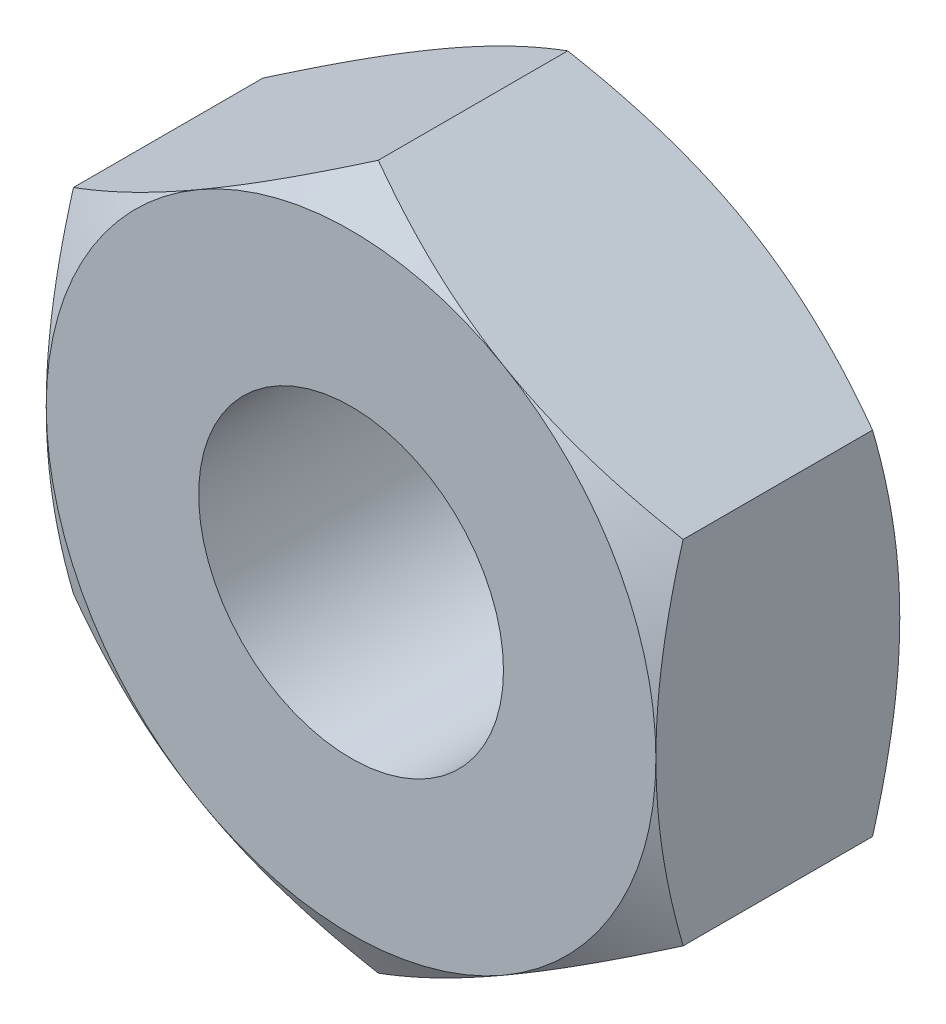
from build123d import *

# Parameters (mm, degrees)
BASE_EXTRUSION_DEPTH    = 1.6
ESQUISSE3_R             = 1
ENL_V_MAT_EXTRU_1_DEPTH = 4.448671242


with BuildPart() as part:
    # Esquisse1 → Base-Extrusion (new body)
    with BuildSketch(Plane.XY):
        Polygon((2, -1.154700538), (2, 1.154700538), (0, 2.309401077), (-2, 1.154700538), (-2, -1.154700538), (0, -2.309401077), align=None)
    extrude(amount=-BASE_EXTRUSION_DEPTH)

    # Esquisse2 → Enl_vement de mati_re-R_volution1 (revolve, cut)
    with BuildSketch(Plane(origin=(0, 0, 0), x_dir=(1, 0, 0), z_dir=(0, 1, 0))):
        Polygon((-2, 0), (-4.385640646, 0), (-4.385640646, 1.6), (-2, 1.6), (-3.385640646, 0.8), align=None)
    revolve(axis=Axis((0, 0, -1.6), (0, 0, 1)), mode=Mode.SUBTRACT)

    # Esquisse3 → Enl_v. mat.-Extru.1 (cut, through all)
    with BuildSketch(Plane.XY):
        Circle(ESQUISSE3_R)
    extrude(amount=-ENL_V_MAT_EXTRU_1_DEPTH, mode=Mode.SUBTRACT)


solid = part.part
